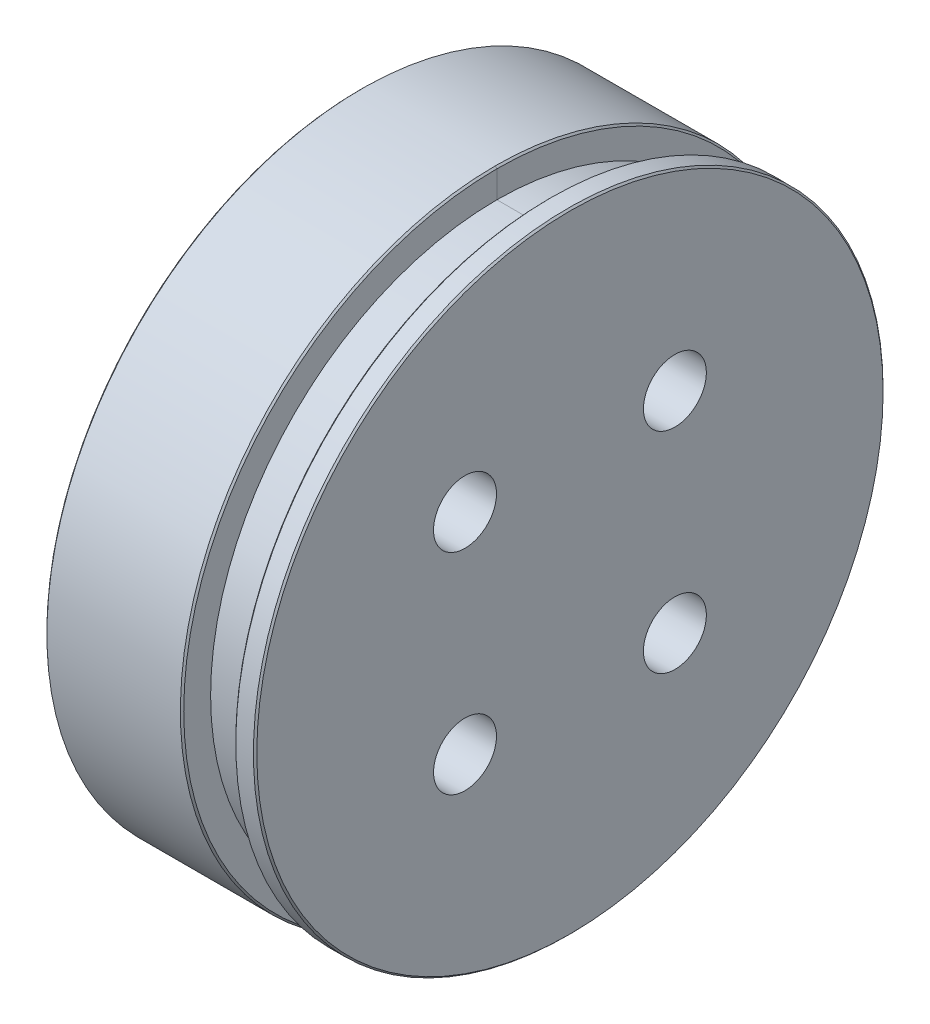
ISO-10303-21;
HEADER;
FILE_DESCRIPTION(('STEP AP214'),'2;1');
FILE_NAME('part.step','',(''),(''),'','','');
FILE_SCHEMA(('AUTOMOTIVE_DESIGN { 1 0 10303 214 1 1 1 1 }'));
ENDSEC;
DATA;
#1=APPLICATION_CONTEXT('core data for automotive mechanical design processes');
#2=APPLICATION_PROTOCOL_DEFINITION('international standard','automotive_design',2000,#1);
#3=PRODUCT_CONTEXT('',#1,'mechanical');
#4=PRODUCT('Part','Part','',(#3));
#5=PRODUCT_RELATED_PRODUCT_CATEGORY('part','',(#4));
#6=PRODUCT_DEFINITION_FORMATION('','',#4);
#7=PRODUCT_DEFINITION_CONTEXT('part definition',#1,'design');
#8=PRODUCT_DEFINITION('design','',#6,#7);
#9=PRODUCT_DEFINITION_SHAPE('','',#8);
#10=(LENGTH_UNIT() NAMED_UNIT(*) SI_UNIT(.MILLI.,.METRE.));
#11=(NAMED_UNIT(*) PLANE_ANGLE_UNIT() SI_UNIT($,.RADIAN.));
#12=(NAMED_UNIT(*) SI_UNIT($,.STERADIAN.) SOLID_ANGLE_UNIT());
#13=UNCERTAINTY_MEASURE_WITH_UNIT(LENGTH_MEASURE(1.E-05),#10,'distance_accuracy_value','');
#14=(GEOMETRIC_REPRESENTATION_CONTEXT(3) GLOBAL_UNCERTAINTY_ASSIGNED_CONTEXT((#13)) GLOBAL_UNIT_ASSIGNED_CONTEXT((#10,
#11,#12)) REPRESENTATION_CONTEXT('',''));
#15=CARTESIAN_POINT('',(0.,0.,0.));
#16=DIRECTION('',(0.,0.,1.));
#17=DIRECTION('',(1.,0.,0.));
#18=AXIS2_PLACEMENT_3D('',#15,#16,#17);
#19=CARTESIAN_POINT('',(-31.75,0.,0.));
#20=DIRECTION('',(1.,0.,0.));
#21=DIRECTION('',(0.,0.,-1.));
#22=AXIS2_PLACEMENT_3D('',#19,#20,#21);
#23=CYLINDRICAL_SURFACE('',#22,47.625);
#24=CARTESIAN_POINT('',(-31.496,0.,0.));
#25=DIRECTION('',(1.,0.,0.));
#26=DIRECTION('',(0.,0.,-1.));
#27=AXIS2_PLACEMENT_3D('',#24,#25,#26);
#28=CIRCLE('',#27,47.625);
#29=CARTESIAN_POINT('',(-31.496,0.,-47.625));
#30=VERTEX_POINT('',#29);
#31=EDGE_CURVE('E254',#30,#30,#28,.T.);
#32=ORIENTED_EDGE('',*,*,#31,.T.);
#33=EDGE_LOOP('',(#32));
#34=FACE_BOUND('',#33,.T.);
#35=CARTESIAN_POINT('',(-11.303,0.,0.));
#36=DIRECTION('',(1.,0.,0.));
#37=DIRECTION('',(0.,0.,-1.));
#38=AXIS2_PLACEMENT_3D('',#35,#36,#37);
#39=CIRCLE('',#38,47.625);
#40=CARTESIAN_POINT('',(-11.303,0.,-47.625));
#41=VERTEX_POINT('',#40);
#42=CARTESIAN_POINT('',(-11.303,47.625,0.));
#43=VERTEX_POINT('',#42);
#44=EDGE_CURVE('E244',#41,#43,#39,.F.);
#45=ORIENTED_EDGE('',*,*,#44,.T.);
#46=CARTESIAN_POINT('',(-11.303,0.,0.));
#47=DIRECTION('',(1.,0.,0.));
#48=DIRECTION('',(0.,0.,-1.));
#49=AXIS2_PLACEMENT_3D('',#46,#47,#48);
#50=CIRCLE('',#49,47.625);
#51=EDGE_CURVE('E250',#43,#41,#50,.F.);
#52=ORIENTED_EDGE('',*,*,#51,.T.);
#53=EDGE_LOOP('',(#45,#52));
#54=FACE_BOUND('',#53,.T.);
#55=ADVANCED_FACE('F47',(#34,#54),#23,.T.);
#56=CARTESIAN_POINT('',(-2.92100000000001,0.,0.));
#57=DIRECTION('',(-1.,0.,0.));
#58=DIRECTION('',(0.,0.,1.));
#59=AXIS2_PLACEMENT_3D('',#56,#57,#58);
#60=CIRCLE('',#59,47.625);
#61=CARTESIAN_POINT('',(-2.92100000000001,47.625,0.));
#62=VERTEX_POINT('',#61);
#63=CARTESIAN_POINT('',(-2.92100000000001,0.,-47.625));
#64=VERTEX_POINT('',#63);
#65=EDGE_CURVE('E270',#62,#64,#60,.F.);
#66=ORIENTED_EDGE('',*,*,#65,.T.);
#67=CARTESIAN_POINT('',(-2.92100000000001,0.,0.));
#68=DIRECTION('',(-1.,0.,0.));
#69=DIRECTION('',(0.,0.,1.));
#70=AXIS2_PLACEMENT_3D('',#67,#68,#69);
#71=CIRCLE('',#70,47.625);
#72=EDGE_CURVE('E273',#64,#62,#71,.F.);
#73=ORIENTED_EDGE('',*,*,#72,.T.);
#74=EDGE_LOOP('',(#66,#73));
#75=FACE_BOUND('',#74,.T.);
#76=CARTESIAN_POINT('',(-0.253999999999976,0.,0.));
#77=DIRECTION('',(1.,0.,0.));
#78=DIRECTION('',(0.,0.,-1.));
#79=AXIS2_PLACEMENT_3D('',#76,#77,#78);
#80=CIRCLE('',#79,47.625);
#81=CARTESIAN_POINT('',(-0.253999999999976,0.,-47.625));
#82=VERTEX_POINT('',#81);
#83=EDGE_CURVE('E266',#82,#82,#80,.F.);
#84=ORIENTED_EDGE('',*,*,#83,.T.);
#85=EDGE_LOOP('',(#84));
#86=FACE_BOUND('',#85,.T.);
#87=ADVANCED_FACE('F299',(#75,#86),#23,.T.);
#88=CARTESIAN_POINT('',(-31.75,0.,0.));
#89=DIRECTION('',(1.,0.,0.));
#90=DIRECTION('',(0.,0.,-1.));
#91=AXIS2_PLACEMENT_3D('',#88,#89,#90);
#92=PLANE('',#91);
#93=CARTESIAN_POINT('',(-31.75,0.,0.));
#94=DIRECTION('',(1.,0.,0.));
#95=DIRECTION('',(0.,0.,-1.));
#96=AXIS2_PLACEMENT_3D('',#93,#94,#95);
#97=CIRCLE('',#96,47.371);
#98=CARTESIAN_POINT('',(-31.75,0.,-47.371));
#99=VERTEX_POINT('',#98);
#100=EDGE_CURVE('E258',#99,#99,#97,.F.);
#101=ORIENTED_EDGE('',*,*,#100,.T.);
#102=EDGE_LOOP('',(#101));
#103=FACE_BOUND('',#102,.T.);
#104=CARTESIAN_POINT('',(-31.75,-15.875,15.875));
#105=DIRECTION('',(1.,0.,0.));
#106=DIRECTION('',(0.,0.,-1.));
#107=AXIS2_PLACEMENT_3D('',#104,#105,#106);
#108=CIRCLE('',#107,4.7625);
#109=CARTESIAN_POINT('',(-31.75,-15.875,11.1125));
#110=VERTEX_POINT('',#109);
#111=EDGE_CURVE('E147',#110,#110,#108,.T.);
#112=ORIENTED_EDGE('',*,*,#111,.T.);
#113=EDGE_LOOP('',(#112));
#114=FACE_BOUND('',#113,.T.);
#115=CARTESIAN_POINT('',(-31.75,-15.875,-15.875));
#116=DIRECTION('',(1.,0.,0.));
#117=DIRECTION('',(0.,0.,-1.));
#118=AXIS2_PLACEMENT_3D('',#115,#116,#117);
#119=CIRCLE('',#118,4.7625);
#120=CARTESIAN_POINT('',(-31.75,-15.875,-20.6375));
#121=VERTEX_POINT('',#120);
#122=EDGE_CURVE('E165',#121,#121,#119,.T.);
#123=ORIENTED_EDGE('',*,*,#122,.T.);
#124=EDGE_LOOP('',(#123));
#125=FACE_BOUND('',#124,.T.);
#126=CARTESIAN_POINT('',(-31.75,15.875,-15.875));
#127=DIRECTION('',(1.,0.,0.));
#128=DIRECTION('',(0.,0.,-1.));
#129=AXIS2_PLACEMENT_3D('',#126,#127,#128);
#130=CIRCLE('',#129,4.7625);
#131=CARTESIAN_POINT('',(-31.75,15.875,-20.6375));
#132=VERTEX_POINT('',#131);
#133=EDGE_CURVE('E157',#132,#132,#130,.T.);
#134=ORIENTED_EDGE('',*,*,#133,.T.);
#135=EDGE_LOOP('',(#134));
#136=FACE_BOUND('',#135,.T.);
#137=CARTESIAN_POINT('',(-31.75,15.875,15.875));
#138=DIRECTION('',(1.,0.,0.));
#139=DIRECTION('',(0.,0.,-1.));
#140=AXIS2_PLACEMENT_3D('',#137,#138,#139);
#141=CIRCLE('',#140,4.7625);
#142=CARTESIAN_POINT('',(-31.75,15.875,11.1125));
#143=VERTEX_POINT('',#142);
#144=EDGE_CURVE('E176',#143,#143,#141,.T.);
#145=ORIENTED_EDGE('',*,*,#144,.T.);
#146=EDGE_LOOP('',(#145));
#147=FACE_BOUND('',#146,.T.);
#148=CARTESIAN_POINT('',(-31.75,38.1,0.));
#149=DIRECTION('',(-1.,0.,0.));
#150=DIRECTION('',(0.,0.,1.));
#151=AXIS2_PLACEMENT_3D('',#148,#149,#150);
#152=CIRCLE('',#151,3.96875);
#153=CARTESIAN_POINT('',(-31.75,38.1,3.96875));
#154=VERTEX_POINT('',#153);
#155=EDGE_CURVE('E208',#154,#154,#152,.T.);
#156=ORIENTED_EDGE('',*,*,#155,.F.);
#157=EDGE_LOOP('',(#156));
#158=FACE_BOUND('',#157,.T.);
#159=CARTESIAN_POINT('',(-31.75,26.9407683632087,26.940768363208));
#160=DIRECTION('',(-1.,0.,0.));
#161=DIRECTION('',(0.,0.,1.));
#162=AXIS2_PLACEMENT_3D('',#159,#160,#161);
#163=CIRCLE('',#162,3.96874999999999);
#164=CARTESIAN_POINT('',(-31.75,26.9407683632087,30.909518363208));
#165=VERTEX_POINT('',#164);
#166=EDGE_CURVE('E217',#165,#165,#163,.T.);
#167=ORIENTED_EDGE('',*,*,#166,.F.);
#168=EDGE_LOOP('',(#167));
#169=FACE_BOUND('',#168,.T.);
#170=CARTESIAN_POINT('',(-31.75,0.,38.1));
#171=DIRECTION('',(-1.,0.,0.));
#172=DIRECTION('',(0.,0.,1.));
#173=AXIS2_PLACEMENT_3D('',#170,#171,#172);
#174=CIRCLE('',#173,3.96875);
#175=CARTESIAN_POINT('',(-31.75,0.,42.06875));
#176=VERTEX_POINT('',#175);
#177=EDGE_CURVE('E225',#176,#176,#174,.T.);
#178=ORIENTED_EDGE('',*,*,#177,.F.);
#179=EDGE_LOOP('',(#178));
#180=FACE_BOUND('',#179,.T.);
#181=CARTESIAN_POINT('',(-31.75,-26.9407683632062,26.9407683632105));
#182=DIRECTION('',(-1.,0.,0.));
#183=DIRECTION('',(0.,0.,1.));
#184=AXIS2_PLACEMENT_3D('',#181,#182,#183);
#185=CIRCLE('',#184,3.96875);
#186=CARTESIAN_POINT('',(-31.75,-26.9407683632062,30.9095183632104));
#187=VERTEX_POINT('',#186);
#188=EDGE_CURVE('E233',#187,#187,#185,.T.);
#189=ORIENTED_EDGE('',*,*,#188,.F.);
#190=EDGE_LOOP('',(#189));
#191=FACE_BOUND('',#190,.T.);
#192=CARTESIAN_POINT('',(-31.75,-38.1,0.));
#193=DIRECTION('',(-1.,0.,0.));
#194=DIRECTION('',(0.,0.,1.));
#195=AXIS2_PLACEMENT_3D('',#192,#193,#194);
#196=CIRCLE('',#195,3.96875);
#197=CARTESIAN_POINT('',(-31.75,-38.1,3.96875));
#198=VERTEX_POINT('',#197);
#199=EDGE_CURVE('E184',#198,#198,#196,.T.);
#200=ORIENTED_EDGE('',*,*,#199,.F.);
#201=EDGE_LOOP('',(#200));
#202=FACE_BOUND('',#201,.T.);
#203=CARTESIAN_POINT('',(-31.75,-26.9407683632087,-26.9407683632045));
#204=DIRECTION('',(-1.,0.,0.));
#205=DIRECTION('',(0.,0.,1.));
#206=AXIS2_PLACEMENT_3D('',#203,#204,#205);
#207=CIRCLE('',#206,3.96875);
#208=CARTESIAN_POINT('',(-31.75,-26.9407683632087,-22.9720183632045));
#209=VERTEX_POINT('',#208);
#210=EDGE_CURVE('E193',#209,#209,#207,.T.);
#211=ORIENTED_EDGE('',*,*,#210,.F.);
#212=EDGE_LOOP('',(#211));
#213=FACE_BOUND('',#212,.T.);
#214=CARTESIAN_POINT('',(-31.75,0.,-38.1));
#215=DIRECTION('',(-1.,0.,0.));
#216=DIRECTION('',(0.,0.,1.));
#217=AXIS2_PLACEMENT_3D('',#214,#215,#216);
#218=CIRCLE('',#217,3.96875);
#219=CARTESIAN_POINT('',(-31.75,0.,-34.13125));
#220=VERTEX_POINT('',#219);
#221=EDGE_CURVE('E201',#220,#220,#218,.T.);
#222=ORIENTED_EDGE('',*,*,#221,.F.);
#223=EDGE_LOOP('',(#222));
#224=FACE_BOUND('',#223,.T.);
#225=CARTESIAN_POINT('',(-31.75,26.9407683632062,-26.940768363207));
#226=DIRECTION('',(-1.,0.,0.));
#227=DIRECTION('',(0.,0.,1.));
#228=AXIS2_PLACEMENT_3D('',#225,#226,#227);
#229=CIRCLE('',#228,3.96875);
#230=CARTESIAN_POINT('',(-31.75,26.9407683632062,-22.972018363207));
#231=VERTEX_POINT('',#230);
#232=EDGE_CURVE('E212',#231,#231,#229,.T.);
#233=ORIENTED_EDGE('',*,*,#232,.F.);
#234=EDGE_LOOP('',(#233));
#235=FACE_BOUND('',#234,.T.);
#236=ADVANCED_FACE('F305',(#103,#114,#125,#136,#147,#158,#169,#180,#191,#202,#213,#224,#235),
#92,.F.);
#237=CARTESIAN_POINT('',(0.,0.,0.));
#238=DIRECTION('',(1.,0.,0.));
#239=DIRECTION('',(0.,0.,-1.));
#240=AXIS2_PLACEMENT_3D('',#237,#238,#239);
#241=PLANE('',#240);
#242=CARTESIAN_POINT('',(0.,0.,0.));
#243=DIRECTION('',(1.,0.,0.));
#244=DIRECTION('',(0.,0.,-1.));
#245=AXIS2_PLACEMENT_3D('',#242,#243,#244);
#246=CIRCLE('',#245,47.371);
#247=CARTESIAN_POINT('',(0.,0.,-47.371));
#248=VERTEX_POINT('',#247);
#249=EDGE_CURVE('E280',#248,#248,#246,.T.);
#250=ORIENTED_EDGE('',*,*,#249,.T.);
#251=EDGE_LOOP('',(#250));
#252=FACE_BOUND('',#251,.T.);
#253=CARTESIAN_POINT('',(0.,-15.875,15.875));
#254=DIRECTION('',(1.,0.,0.));
#255=DIRECTION('',(0.,0.,-1.));
#256=AXIS2_PLACEMENT_3D('',#253,#254,#255);
#257=CIRCLE('',#256,4.7625);
#258=CARTESIAN_POINT('',(0.,-15.875,11.1125));
#259=VERTEX_POINT('',#258);
#260=EDGE_CURVE('E169',#259,#259,#257,.T.);
#261=ORIENTED_EDGE('',*,*,#260,.F.);
#262=EDGE_LOOP('',(#261));
#263=FACE_BOUND('',#262,.T.);
#264=CARTESIAN_POINT('',(0.,-15.875,-15.875));
#265=DIRECTION('',(1.,0.,0.));
#266=DIRECTION('',(0.,0.,-1.));
#267=AXIS2_PLACEMENT_3D('',#264,#265,#266);
#268=CIRCLE('',#267,4.7625);
#269=CARTESIAN_POINT('',(0.,-15.875,-20.6375));
#270=VERTEX_POINT('',#269);
#271=EDGE_CURVE('E161',#270,#270,#268,.T.);
#272=ORIENTED_EDGE('',*,*,#271,.F.);
#273=EDGE_LOOP('',(#272));
#274=FACE_BOUND('',#273,.T.);
#275=CARTESIAN_POINT('',(0.,15.875,-15.875));
#276=DIRECTION('',(1.,0.,0.));
#277=DIRECTION('',(0.,0.,-1.));
#278=AXIS2_PLACEMENT_3D('',#275,#276,#277);
#279=CIRCLE('',#278,4.7625);
#280=CARTESIAN_POINT('',(0.,15.875,-20.6375));
#281=VERTEX_POINT('',#280);
#282=EDGE_CURVE('E152',#281,#281,#279,.T.);
#283=ORIENTED_EDGE('',*,*,#282,.F.);
#284=EDGE_LOOP('',(#283));
#285=FACE_BOUND('',#284,.T.);
#286=CARTESIAN_POINT('',(0.,15.875,15.875));
#287=DIRECTION('',(1.,0.,0.));
#288=DIRECTION('',(0.,0.,-1.));
#289=AXIS2_PLACEMENT_3D('',#286,#287,#288);
#290=CIRCLE('',#289,4.7625);
#291=CARTESIAN_POINT('',(0.,15.875,11.1125));
#292=VERTEX_POINT('',#291);
#293=EDGE_CURVE('E156',#292,#292,#290,.T.);
#294=ORIENTED_EDGE('',*,*,#293,.F.);
#295=EDGE_LOOP('',(#294));
#296=FACE_BOUND('',#295,.T.);
#297=ADVANCED_FACE('F309',(#252,#263,#274,#285,#296),#241,.T.);
#298=CARTESIAN_POINT('',(-15.875,26.9407683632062,-26.940768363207));
#299=DIRECTION('',(-1.,0.,0.));
#300=DIRECTION('',(0.,0.,1.));
#301=AXIS2_PLACEMENT_3D('',#298,#299,#300);
#302=CYLINDRICAL_SURFACE('',#301,3.96875);
#303=CARTESIAN_POINT('',(-15.875,26.9407683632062,-26.940768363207));
#304=DIRECTION('',(-1.,0.,0.));
#305=DIRECTION('',(0.,0.,1.));
#306=AXIS2_PLACEMENT_3D('',#303,#304,#305);
#307=CIRCLE('',#306,3.96875);
#308=CARTESIAN_POINT('',(-15.875,26.9407683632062,-22.972018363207));
#309=VERTEX_POINT('',#308);
#310=EDGE_CURVE('E240',#309,#309,#307,.T.);
#311=ORIENTED_EDGE('',*,*,#310,.F.);
#312=EDGE_LOOP('',(#311));
#313=FACE_BOUND('',#312,.T.);
#314=ORIENTED_EDGE('',*,*,#232,.T.);
#315=EDGE_LOOP('',(#314));
#316=FACE_BOUND('',#315,.T.);
#317=ADVANCED_FACE('F555',(#313,#316),#302,.F.);
#318=CARTESIAN_POINT('',(-15.875,26.9407683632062,-26.940768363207));
#319=DIRECTION('',(-1.,0.,0.));
#320=DIRECTION('',(0.,0.,1.));
#321=AXIS2_PLACEMENT_3D('',#318,#319,#320);
#322=PLANE('',#321);
#323=ORIENTED_EDGE('',*,*,#310,.T.);
#324=EDGE_LOOP('',(#323));
#325=FACE_BOUND('',#324,.T.);
#326=ADVANCED_FACE('F547',(#325),#322,.T.);
#327=CARTESIAN_POINT('',(-15.875,0.,-38.1));
#328=DIRECTION('',(-1.,0.,0.));
#329=DIRECTION('',(0.,0.,1.));
#330=AXIS2_PLACEMENT_3D('',#327,#328,#329);
#331=CYLINDRICAL_SURFACE('',#330,3.96875);
#332=CARTESIAN_POINT('',(-15.875,0.,-38.1));
#333=DIRECTION('',(-1.,0.,0.));
#334=DIRECTION('',(0.,0.,1.));
#335=AXIS2_PLACEMENT_3D('',#332,#333,#334);
#336=CIRCLE('',#335,3.96875);
#337=CARTESIAN_POINT('',(-15.875,0.,-34.13125));
#338=VERTEX_POINT('',#337);
#339=EDGE_CURVE('E180',#338,#338,#336,.T.);
#340=ORIENTED_EDGE('',*,*,#339,.F.);
#341=EDGE_LOOP('',(#340));
#342=FACE_BOUND('',#341,.T.);
#343=ORIENTED_EDGE('',*,*,#221,.T.);
#344=EDGE_LOOP('',(#343));
#345=FACE_BOUND('',#344,.T.);
#346=ADVANCED_FACE('F539',(#342,#345),#331,.F.);
#347=CARTESIAN_POINT('',(-15.875,0.,-38.1));
#348=DIRECTION('',(-1.,0.,0.));
#349=DIRECTION('',(0.,0.,1.));
#350=AXIS2_PLACEMENT_3D('',#347,#348,#349);
#351=PLANE('',#350);
#352=ORIENTED_EDGE('',*,*,#339,.T.);
#353=EDGE_LOOP('',(#352));
#354=FACE_BOUND('',#353,.T.);
#355=ADVANCED_FACE('F531',(#354),#351,.T.);
#356=CARTESIAN_POINT('',(-15.875,-26.9407683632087,-26.9407683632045));
#357=DIRECTION('',(-1.,0.,0.));
#358=DIRECTION('',(0.,0.,1.));
#359=AXIS2_PLACEMENT_3D('',#356,#357,#358);
#360=CYLINDRICAL_SURFACE('',#359,3.96875);
#361=CARTESIAN_POINT('',(-15.875,-26.9407683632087,-26.9407683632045));
#362=DIRECTION('',(-1.,0.,0.));
#363=DIRECTION('',(0.,0.,1.));
#364=AXIS2_PLACEMENT_3D('',#361,#362,#363);
#365=CIRCLE('',#364,3.96875);
#366=CARTESIAN_POINT('',(-15.875,-26.9407683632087,-22.9720183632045));
#367=VERTEX_POINT('',#366);
#368=EDGE_CURVE('E197',#367,#367,#365,.T.);
#369=ORIENTED_EDGE('',*,*,#368,.F.);
#370=EDGE_LOOP('',(#369));
#371=FACE_BOUND('',#370,.T.);
#372=ORIENTED_EDGE('',*,*,#210,.T.);
#373=EDGE_LOOP('',(#372));
#374=FACE_BOUND('',#373,.T.);
#375=ADVANCED_FACE('F523',(#371,#374),#360,.F.);
#376=CARTESIAN_POINT('',(-15.875,-26.9407683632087,-26.9407683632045));
#377=DIRECTION('',(-1.,0.,0.));
#378=DIRECTION('',(0.,0.,1.));
#379=AXIS2_PLACEMENT_3D('',#376,#377,#378);
#380=PLANE('',#379);
#381=ORIENTED_EDGE('',*,*,#368,.T.);
#382=EDGE_LOOP('',(#381));
#383=FACE_BOUND('',#382,.T.);
#384=ADVANCED_FACE('F515',(#383),#380,.T.);
#385=CARTESIAN_POINT('',(-15.875,-38.1,0.));
#386=DIRECTION('',(-1.,0.,0.));
#387=DIRECTION('',(0.,0.,1.));
#388=AXIS2_PLACEMENT_3D('',#385,#386,#387);
#389=CYLINDRICAL_SURFACE('',#388,3.96875);
#390=CARTESIAN_POINT('',(-15.875,-38.1,0.));
#391=DIRECTION('',(-1.,0.,0.));
#392=DIRECTION('',(0.,0.,1.));
#393=AXIS2_PLACEMENT_3D('',#390,#391,#392);
#394=CIRCLE('',#393,3.96875);
#395=CARTESIAN_POINT('',(-15.875,-38.1,3.96875));
#396=VERTEX_POINT('',#395);
#397=EDGE_CURVE('E189',#396,#396,#394,.T.);
#398=ORIENTED_EDGE('',*,*,#397,.F.);
#399=EDGE_LOOP('',(#398));
#400=FACE_BOUND('',#399,.T.);
#401=ORIENTED_EDGE('',*,*,#199,.T.);
#402=EDGE_LOOP('',(#401));
#403=FACE_BOUND('',#402,.T.);
#404=ADVANCED_FACE('F507',(#400,#403),#389,.F.);
#405=CARTESIAN_POINT('',(-15.875,-38.1,0.));
#406=DIRECTION('',(-1.,0.,0.));
#407=DIRECTION('',(0.,0.,1.));
#408=AXIS2_PLACEMENT_3D('',#405,#406,#407);
#409=PLANE('',#408);
#410=ORIENTED_EDGE('',*,*,#397,.T.);
#411=EDGE_LOOP('',(#410));
#412=FACE_BOUND('',#411,.T.);
#413=ADVANCED_FACE('F499',(#412),#409,.T.);
#414=CARTESIAN_POINT('',(-15.875,-26.9407683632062,26.9407683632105));
#415=DIRECTION('',(-1.,0.,0.));
#416=DIRECTION('',(0.,0.,1.));
#417=AXIS2_PLACEMENT_3D('',#414,#415,#416);
#418=CYLINDRICAL_SURFACE('',#417,3.96875);
#419=CARTESIAN_POINT('',(-15.875,-26.9407683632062,26.9407683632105));
#420=DIRECTION('',(-1.,0.,0.));
#421=DIRECTION('',(0.,0.,1.));
#422=AXIS2_PLACEMENT_3D('',#419,#420,#421);
#423=CIRCLE('',#422,3.96875);
#424=CARTESIAN_POINT('',(-15.875,-26.9407683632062,30.9095183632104));
#425=VERTEX_POINT('',#424);
#426=EDGE_CURVE('E188',#425,#425,#423,.T.);
#427=ORIENTED_EDGE('',*,*,#426,.F.);
#428=EDGE_LOOP('',(#427));
#429=FACE_BOUND('',#428,.T.);
#430=ORIENTED_EDGE('',*,*,#188,.T.);
#431=EDGE_LOOP('',(#430));
#432=FACE_BOUND('',#431,.T.);
#433=ADVANCED_FACE('F491',(#429,#432),#418,.F.);
#434=CARTESIAN_POINT('',(-15.875,-26.9407683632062,26.9407683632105));
#435=DIRECTION('',(-1.,0.,0.));
#436=DIRECTION('',(0.,0.,1.));
#437=AXIS2_PLACEMENT_3D('',#434,#435,#436);
#438=PLANE('',#437);
#439=ORIENTED_EDGE('',*,*,#426,.T.);
#440=EDGE_LOOP('',(#439));
#441=FACE_BOUND('',#440,.T.);
#442=ADVANCED_FACE('F483',(#441),#438,.T.);
#443=CARTESIAN_POINT('',(-15.875,0.,38.1));
#444=DIRECTION('',(-1.,0.,0.));
#445=DIRECTION('',(0.,0.,1.));
#446=AXIS2_PLACEMENT_3D('',#443,#444,#445);
#447=CYLINDRICAL_SURFACE('',#446,3.96875);
#448=CARTESIAN_POINT('',(-15.875,0.,38.1));
#449=DIRECTION('',(-1.,0.,0.));
#450=DIRECTION('',(0.,0.,1.));
#451=AXIS2_PLACEMENT_3D('',#448,#449,#450);
#452=CIRCLE('',#451,3.96875);
#453=CARTESIAN_POINT('',(-15.875,0.,42.06875));
#454=VERTEX_POINT('',#453);
#455=EDGE_CURVE('E229',#454,#454,#452,.T.);
#456=ORIENTED_EDGE('',*,*,#455,.F.);
#457=EDGE_LOOP('',(#456));
#458=FACE_BOUND('',#457,.T.);
#459=ORIENTED_EDGE('',*,*,#177,.T.);
#460=EDGE_LOOP('',(#459));
#461=FACE_BOUND('',#460,.T.);
#462=ADVANCED_FACE('F475',(#458,#461),#447,.F.);
#463=CARTESIAN_POINT('',(-15.875,0.,38.1));
#464=DIRECTION('',(-1.,0.,0.));
#465=DIRECTION('',(0.,0.,1.));
#466=AXIS2_PLACEMENT_3D('',#463,#464,#465);
#467=PLANE('',#466);
#468=ORIENTED_EDGE('',*,*,#455,.T.);
#469=EDGE_LOOP('',(#468));
#470=FACE_BOUND('',#469,.T.);
#471=ADVANCED_FACE('F467',(#470),#467,.T.);
#472=CARTESIAN_POINT('',(-15.875,26.9407683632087,26.940768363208));
#473=DIRECTION('',(-1.,0.,0.));
#474=DIRECTION('',(0.,0.,1.));
#475=AXIS2_PLACEMENT_3D('',#472,#473,#474);
#476=CYLINDRICAL_SURFACE('',#475,3.96874999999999);
#477=CARTESIAN_POINT('',(-15.875,26.9407683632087,26.940768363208));
#478=DIRECTION('',(-1.,0.,0.));
#479=DIRECTION('',(0.,0.,1.));
#480=AXIS2_PLACEMENT_3D('',#477,#478,#479);
#481=CIRCLE('',#480,3.96874999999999);
#482=CARTESIAN_POINT('',(-15.875,26.9407683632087,30.909518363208));
#483=VERTEX_POINT('',#482);
#484=EDGE_CURVE('E221',#483,#483,#481,.T.);
#485=ORIENTED_EDGE('',*,*,#484,.F.);
#486=EDGE_LOOP('',(#485));
#487=FACE_BOUND('',#486,.T.);
#488=ORIENTED_EDGE('',*,*,#166,.T.);
#489=EDGE_LOOP('',(#488));
#490=FACE_BOUND('',#489,.T.);
#491=ADVANCED_FACE('F459',(#487,#490),#476,.F.);
#492=CARTESIAN_POINT('',(-15.875,26.9407683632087,26.940768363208));
#493=DIRECTION('',(-1.,0.,0.));
#494=DIRECTION('',(0.,0.,1.));
#495=AXIS2_PLACEMENT_3D('',#492,#493,#494);
#496=PLANE('',#495);
#497=ORIENTED_EDGE('',*,*,#484,.T.);
#498=EDGE_LOOP('',(#497));
#499=FACE_BOUND('',#498,.T.);
#500=ADVANCED_FACE('F451',(#499),#496,.T.);
#501=CARTESIAN_POINT('',(-15.875,38.1,0.));
#502=DIRECTION('',(-1.,0.,0.));
#503=DIRECTION('',(0.,0.,1.));
#504=AXIS2_PLACEMENT_3D('',#501,#502,#503);
#505=CYLINDRICAL_SURFACE('',#504,3.96875);
#506=CARTESIAN_POINT('',(-15.875,38.1,0.));
#507=DIRECTION('',(-1.,0.,0.));
#508=DIRECTION('',(0.,0.,1.));
#509=AXIS2_PLACEMENT_3D('',#506,#507,#508);
#510=CIRCLE('',#509,3.96875);
#511=CARTESIAN_POINT('',(-15.875,38.1,3.96875));
#512=VERTEX_POINT('',#511);
#513=EDGE_CURVE('E213',#512,#512,#510,.T.);
#514=ORIENTED_EDGE('',*,*,#513,.F.);
#515=EDGE_LOOP('',(#514));
#516=FACE_BOUND('',#515,.T.);
#517=ORIENTED_EDGE('',*,*,#155,.T.);
#518=EDGE_LOOP('',(#517));
#519=FACE_BOUND('',#518,.T.);
#520=ADVANCED_FACE('F443',(#516,#519),#505,.F.);
#521=CARTESIAN_POINT('',(-15.875,38.1,0.));
#522=DIRECTION('',(-1.,0.,0.));
#523=DIRECTION('',(0.,0.,1.));
#524=AXIS2_PLACEMENT_3D('',#521,#522,#523);
#525=PLANE('',#524);
#526=ORIENTED_EDGE('',*,*,#513,.T.);
#527=EDGE_LOOP('',(#526));
#528=FACE_BOUND('',#527,.T.);
#529=ADVANCED_FACE('F435',(#528),#525,.T.);
#530=CARTESIAN_POINT('',(-31.75,15.875,15.875));
#531=DIRECTION('',(1.,0.,0.));
#532=DIRECTION('',(0.,0.,-1.));
#533=AXIS2_PLACEMENT_3D('',#530,#531,#532);
#534=CYLINDRICAL_SURFACE('',#533,4.7625);
#535=ORIENTED_EDGE('',*,*,#144,.F.);
#536=EDGE_LOOP('',(#535));
#537=FACE_BOUND('',#536,.T.);
#538=ORIENTED_EDGE('',*,*,#293,.T.);
#539=EDGE_LOOP('',(#538));
#540=FACE_BOUND('',#539,.T.);
#541=ADVANCED_FACE('F427',(#537,#540),#534,.F.);
#542=CARTESIAN_POINT('',(-31.75,15.875,-15.875));
#543=DIRECTION('',(1.,0.,0.));
#544=DIRECTION('',(0.,0.,-1.));
#545=AXIS2_PLACEMENT_3D('',#542,#543,#544);
#546=CYLINDRICAL_SURFACE('',#545,4.7625);
#547=ORIENTED_EDGE('',*,*,#133,.F.);
#548=EDGE_LOOP('',(#547));
#549=FACE_BOUND('',#548,.T.);
#550=ORIENTED_EDGE('',*,*,#282,.T.);
#551=EDGE_LOOP('',(#550));
#552=FACE_BOUND('',#551,.T.);
#553=ADVANCED_FACE('F419',(#549,#552),#546,.F.);
#554=CARTESIAN_POINT('',(-31.75,-15.875,-15.875));
#555=DIRECTION('',(1.,0.,0.));
#556=DIRECTION('',(0.,0.,-1.));
#557=AXIS2_PLACEMENT_3D('',#554,#555,#556);
#558=CYLINDRICAL_SURFACE('',#557,4.7625);
#559=ORIENTED_EDGE('',*,*,#122,.F.);
#560=EDGE_LOOP('',(#559));
#561=FACE_BOUND('',#560,.T.);
#562=ORIENTED_EDGE('',*,*,#271,.T.);
#563=EDGE_LOOP('',(#562));
#564=FACE_BOUND('',#563,.T.);
#565=ADVANCED_FACE('F411',(#561,#564),#558,.F.);
#566=CARTESIAN_POINT('',(-31.75,-15.875,15.875));
#567=DIRECTION('',(1.,0.,0.));
#568=DIRECTION('',(0.,0.,-1.));
#569=AXIS2_PLACEMENT_3D('',#566,#567,#568);
#570=CYLINDRICAL_SURFACE('',#569,4.7625);
#571=ORIENTED_EDGE('',*,*,#111,.F.);
#572=EDGE_LOOP('',(#571));
#573=FACE_BOUND('',#572,.T.);
#574=ORIENTED_EDGE('',*,*,#260,.T.);
#575=EDGE_LOOP('',(#574));
#576=FACE_BOUND('',#575,.T.);
#577=ADVANCED_FACE('F404',(#573,#576),#570,.F.);
#578=CARTESIAN_POINT('',(-11.049,0.,-47.625));
#579=DIRECTION('',(1.,0.,0.));
#580=DIRECTION('',(0.,0.,-1.));
#581=AXIS2_PLACEMENT_3D('',#578,#579,#580);
#582=PLANE('',#581);
#583=DIRECTION('',(0.,-1.,0.));
#584=VECTOR('',#583,1.);
#585=CARTESIAN_POINT('',(-11.049,47.625,0.));
#586=LINE('',#585,#584);
#587=CARTESIAN_POINT('',(-11.049,47.371,0.));
#588=VERTEX_POINT('',#587);
#589=CARTESIAN_POINT('',(-11.049,43.307,0.));
#590=VERTEX_POINT('',#589);
#591=EDGE_CURVE('E103',#588,#590,#586,.T.);
#592=ORIENTED_EDGE('',*,*,#591,.F.);
#593=CARTESIAN_POINT('',(-11.049,0.,0.));
#594=DIRECTION('',(1.,0.,0.));
#595=DIRECTION('',(0.,0.,-1.));
#596=AXIS2_PLACEMENT_3D('',#593,#594,#595);
#597=CIRCLE('',#596,47.371);
#598=CARTESIAN_POINT('',(-11.049,0.,-47.371));
#599=VERTEX_POINT('',#598);
#600=EDGE_CURVE('E11',#588,#599,#597,.T.);
#601=ORIENTED_EDGE('',*,*,#600,.T.);
#602=DIRECTION('',(0.,0.,1.));
#603=VECTOR('',#602,1.);
#604=CARTESIAN_POINT('',(-11.049,0.,-47.625));
#605=LINE('',#604,#603);
#606=CARTESIAN_POINT('',(-11.049,0.,-43.307));
#607=VERTEX_POINT('',#606);
#608=EDGE_CURVE('E122',#599,#607,#605,.T.);
#609=ORIENTED_EDGE('',*,*,#608,.T.);
#610=CARTESIAN_POINT('',(-11.049,0.,0.));
#611=DIRECTION('',(-1.,0.,0.));
#612=DIRECTION('',(0.,0.,-1.));
#613=AXIS2_PLACEMENT_3D('',#610,#611,#612);
#614=CIRCLE('',#613,43.307);
#615=EDGE_CURVE('E124',#607,#590,#614,.T.);
#616=ORIENTED_EDGE('',*,*,#615,.T.);
#617=EDGE_LOOP('',(#592,#601,#609,#616));
#618=FACE_BOUND('',#617,.T.);
#619=ADVANCED_FACE('F125',(#618),#582,.T.);
#620=CARTESIAN_POINT('',(-11.049,47.625,0.));
#621=DIRECTION('',(1.,0.,0.));
#622=DIRECTION('',(0.,0.,-1.));
#623=AXIS2_PLACEMENT_3D('',#620,#621,#622);
#624=PLANE('',#623);
#625=ORIENTED_EDGE('',*,*,#608,.F.);
#626=CARTESIAN_POINT('',(-11.049,0.,0.));
#627=DIRECTION('',(1.,0.,0.));
#628=DIRECTION('',(0.,0.,-1.));
#629=AXIS2_PLACEMENT_3D('',#626,#627,#628);
#630=CIRCLE('',#629,47.371);
#631=EDGE_CURVE('E58',#599,#588,#630,.T.);
#632=ORIENTED_EDGE('',*,*,#631,.T.);
#633=ORIENTED_EDGE('',*,*,#591,.T.);
#634=CARTESIAN_POINT('',(-11.049,0.,0.));
#635=DIRECTION('',(-1.,0.,0.));
#636=DIRECTION('',(0.,1.,0.));
#637=AXIS2_PLACEMENT_3D('',#634,#635,#636);
#638=CIRCLE('',#637,43.307);
#639=EDGE_CURVE('E106',#590,#607,#638,.T.);
#640=ORIENTED_EDGE('',*,*,#639,.T.);
#641=EDGE_LOOP('',(#625,#632,#633,#640));
#642=FACE_BOUND('',#641,.T.);
#643=ADVANCED_FACE('F105',(#642),#624,.T.);
#644=CARTESIAN_POINT('',(0.,0.,0.));
#645=DIRECTION('',(-1.,0.,0.));
#646=DIRECTION('',(0.,0.,1.));
#647=AXIS2_PLACEMENT_3D('',#644,#645,#646);
#648=CYLINDRICAL_SURFACE('',#647,43.307);
#649=CARTESIAN_POINT('',(-3.175,0.,0.));
#650=DIRECTION('',(-1.,0.,0.));
#651=DIRECTION('',(0.,1.,0.));
#652=AXIS2_PLACEMENT_3D('',#649,#650,#651);
#653=CIRCLE('',#652,43.307);
#654=CARTESIAN_POINT('',(-3.175,43.307,0.));
#655=VERTEX_POINT('',#654);
#656=CARTESIAN_POINT('',(-3.175,0.,-43.307));
#657=VERTEX_POINT('',#656);
#658=EDGE_CURVE('E143',#655,#657,#653,.T.);
#659=ORIENTED_EDGE('',*,*,#658,.T.);
#660=DIRECTION('',(1.,0.,0.));
#661=VECTOR('',#660,1.);
#662=CARTESIAN_POINT('',(-3.175,0.,-43.307));
#663=LINE('',#662,#661);
#664=EDGE_CURVE('E120',#607,#657,#663,.T.);
#665=ORIENTED_EDGE('',*,*,#664,.F.);
#666=ORIENTED_EDGE('',*,*,#639,.F.);
#667=DIRECTION('',(1.,0.,0.));
#668=VECTOR('',#667,1.);
#669=CARTESIAN_POINT('',(-3.175,43.307,0.));
#670=LINE('',#669,#668);
#671=EDGE_CURVE('E110',#590,#655,#670,.T.);
#672=ORIENTED_EDGE('',*,*,#671,.T.);
#673=EDGE_LOOP('',(#659,#665,#666,#672));
#674=FACE_BOUND('',#673,.T.);
#675=ADVANCED_FACE('F116',(#674),#648,.T.);
#676=CARTESIAN_POINT('',(-3.175,47.625,0.));
#677=DIRECTION('',(-1.,0.,0.));
#678=DIRECTION('',(0.,0.,1.));
#679=AXIS2_PLACEMENT_3D('',#676,#677,#678);
#680=PLANE('',#679);
#681=DIRECTION('',(0.,1.,0.));
#682=VECTOR('',#681,1.);
#683=CARTESIAN_POINT('',(-3.175,47.625,0.));
#684=LINE('',#683,#682);
#685=CARTESIAN_POINT('',(-3.175,47.371,0.));
#686=VERTEX_POINT('',#685);
#687=EDGE_CURVE('E135',#655,#686,#684,.T.);
#688=ORIENTED_EDGE('',*,*,#687,.T.);
#689=CARTESIAN_POINT('',(-3.175,0.,0.));
#690=DIRECTION('',(-1.,0.,0.));
#691=DIRECTION('',(0.,0.,1.));
#692=AXIS2_PLACEMENT_3D('',#689,#690,#691);
#693=CIRCLE('',#692,47.371);
#694=CARTESIAN_POINT('',(-3.175,0.,-47.371));
#695=VERTEX_POINT('',#694);
#696=EDGE_CURVE('E262',#686,#695,#693,.T.);
#697=ORIENTED_EDGE('',*,*,#696,.T.);
#698=DIRECTION('',(0.,0.,-1.));
#699=VECTOR('',#698,1.);
#700=CARTESIAN_POINT('',(-3.175,0.,-47.625));
#701=LINE('',#700,#699);
#702=EDGE_CURVE('E129',#657,#695,#701,.T.);
#703=ORIENTED_EDGE('',*,*,#702,.F.);
#704=ORIENTED_EDGE('',*,*,#658,.F.);
#705=EDGE_LOOP('',(#688,#697,#703,#704));
#706=FACE_BOUND('',#705,.T.);
#707=ADVANCED_FACE('F378',(#706),#680,.T.);
#708=CARTESIAN_POINT('',(0.,0.,0.));
#709=DIRECTION('',(-1.,0.,0.));
#710=DIRECTION('',(0.,0.,1.));
#711=AXIS2_PLACEMENT_3D('',#708,#709,#710);
#712=CYLINDRICAL_SURFACE('',#711,43.307);
#713=ORIENTED_EDGE('',*,*,#671,.F.);
#714=ORIENTED_EDGE('',*,*,#615,.F.);
#715=ORIENTED_EDGE('',*,*,#664,.T.);
#716=CARTESIAN_POINT('',(-3.175,0.,0.));
#717=DIRECTION('',(-1.,0.,0.));
#718=DIRECTION('',(0.,0.,-1.));
#719=AXIS2_PLACEMENT_3D('',#716,#717,#718);
#720=CIRCLE('',#719,43.307);
#721=EDGE_CURVE('E128',#657,#655,#720,.T.);
#722=ORIENTED_EDGE('',*,*,#721,.T.);
#723=EDGE_LOOP('',(#713,#714,#715,#722));
#724=FACE_BOUND('',#723,.T.);
#725=ADVANCED_FACE('F131',(#724),#712,.T.);
#726=CARTESIAN_POINT('',(-3.175,0.,-47.625));
#727=DIRECTION('',(-1.,0.,0.));
#728=DIRECTION('',(0.,0.,1.));
#729=AXIS2_PLACEMENT_3D('',#726,#727,#728);
#730=PLANE('',#729);
#731=ORIENTED_EDGE('',*,*,#702,.T.);
#732=CARTESIAN_POINT('',(-3.175,0.,0.));
#733=DIRECTION('',(-1.,0.,0.));
#734=DIRECTION('',(0.,0.,1.));
#735=AXIS2_PLACEMENT_3D('',#732,#733,#734);
#736=CIRCLE('',#735,47.371);
#737=EDGE_CURVE('E277',#695,#686,#736,.T.);
#738=ORIENTED_EDGE('',*,*,#737,.T.);
#739=ORIENTED_EDGE('',*,*,#687,.F.);
#740=ORIENTED_EDGE('',*,*,#721,.F.);
#741=EDGE_LOOP('',(#731,#738,#739,#740));
#742=FACE_BOUND('',#741,.T.);
#743=ADVANCED_FACE('F319',(#742),#730,.T.);
#744=CARTESIAN_POINT('',(-31.496,0.,0.));
#745=DIRECTION('',(1.,0.,0.));
#746=DIRECTION('',(0.,0.,-1.));
#747=AXIS2_PLACEMENT_3D('',#744,#745,#746);
#748=CONICAL_SURFACE('',#747,47.625,0.785398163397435);
#749=ORIENTED_EDGE('',*,*,#100,.F.);
#750=EDGE_LOOP('',(#749));
#751=FACE_BOUND('',#750,.T.);
#752=ORIENTED_EDGE('',*,*,#31,.F.);
#753=EDGE_LOOP('',(#752));
#754=FACE_BOUND('',#753,.T.);
#755=ADVANCED_FACE('F312',(#751,#754),#748,.T.);
#756=CARTESIAN_POINT('',(-3.175,0.,0.));
#757=DIRECTION('',(1.,0.,0.));
#758=DIRECTION('',(0.,0.,-1.));
#759=AXIS2_PLACEMENT_3D('',#756,#757,#758);
#760=CONICAL_SURFACE('',#759,47.371,0.785398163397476);
#761=DIRECTION('',(-0.707106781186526,0.,0.707106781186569));
#762=VECTOR('',#761,1.);
#763=CARTESIAN_POINT('',(-2.92100000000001,0.,-47.625));
#764=LINE('',#763,#762);
#765=EDGE_CURVE('E286',#64,#695,#764,.T.);
#766=ORIENTED_EDGE('',*,*,#765,.F.);
#767=ORIENTED_EDGE('',*,*,#65,.F.);
#768=DIRECTION('',(0.707106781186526,0.707106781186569,0.));
#769=VECTOR('',#768,1.);
#770=CARTESIAN_POINT('',(-3.175,47.371,0.));
#771=LINE('',#770,#769);
#772=EDGE_CURVE('E111',#686,#62,#771,.T.);
#773=ORIENTED_EDGE('',*,*,#772,.F.);
#774=ORIENTED_EDGE('',*,*,#737,.F.);
#775=EDGE_LOOP('',(#766,#767,#773,#774));
#776=FACE_BOUND('',#775,.T.);
#777=ADVANCED_FACE('F318',(#776),#760,.T.);
#778=CARTESIAN_POINT('',(-3.175,0.,0.));
#779=DIRECTION('',(1.,0.,0.));
#780=DIRECTION('',(0.,0.,-1.));
#781=AXIS2_PLACEMENT_3D('',#778,#779,#780);
#782=CONICAL_SURFACE('',#781,47.371,0.785398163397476);
#783=ORIENTED_EDGE('',*,*,#772,.T.);
#784=ORIENTED_EDGE('',*,*,#72,.F.);
#785=ORIENTED_EDGE('',*,*,#765,.T.);
#786=ORIENTED_EDGE('',*,*,#696,.F.);
#787=EDGE_LOOP('',(#783,#784,#785,#786));
#788=FACE_BOUND('',#787,.T.);
#789=ADVANCED_FACE('F322',(#788),#782,.T.);
#790=CARTESIAN_POINT('',(0.,0.,0.));
#791=DIRECTION('',(-1.,0.,0.));
#792=DIRECTION('',(0.,0.,1.));
#793=AXIS2_PLACEMENT_3D('',#790,#791,#792);
#794=CONICAL_SURFACE('',#793,47.371,0.785398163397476);
#795=ORIENTED_EDGE('',*,*,#83,.F.);
#796=EDGE_LOOP('',(#795));
#797=FACE_BOUND('',#796,.T.);
#798=ORIENTED_EDGE('',*,*,#249,.F.);
#799=EDGE_LOOP('',(#798));
#800=FACE_BOUND('',#799,.T.);
#801=ADVANCED_FACE('F328',(#797,#800),#794,.T.);
#802=CARTESIAN_POINT('',(-11.303,0.,0.));
#803=DIRECTION('',(-1.,0.,0.));
#804=DIRECTION('',(0.,0.,1.));
#805=AXIS2_PLACEMENT_3D('',#802,#803,#804);
#806=CONICAL_SURFACE('',#805,47.625,0.785398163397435);
#807=DIRECTION('',(-0.707106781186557,0.,-0.707106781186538));
#808=VECTOR('',#807,1.);
#809=CARTESIAN_POINT('',(-11.049,0.,-47.371));
#810=LINE('',#809,#808);
#811=EDGE_CURVE('E290',#599,#41,#810,.T.);
#812=ORIENTED_EDGE('',*,*,#811,.F.);
#813=ORIENTED_EDGE('',*,*,#600,.F.);
#814=DIRECTION('',(0.707106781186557,-0.707106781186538,0.));
#815=VECTOR('',#814,1.);
#816=CARTESIAN_POINT('',(-11.303,47.625,0.));
#817=LINE('',#816,#815);
#818=EDGE_CURVE('E52',#43,#588,#817,.T.);
#819=ORIENTED_EDGE('',*,*,#818,.F.);
#820=ORIENTED_EDGE('',*,*,#44,.F.);
#821=EDGE_LOOP('',(#812,#813,#819,#820));
#822=FACE_BOUND('',#821,.T.);
#823=ADVANCED_FACE('F50',(#822),#806,.T.);
#824=CARTESIAN_POINT('',(-11.303,0.,0.));
#825=DIRECTION('',(-1.,0.,0.));
#826=DIRECTION('',(0.,0.,1.));
#827=AXIS2_PLACEMENT_3D('',#824,#825,#826);
#828=CONICAL_SURFACE('',#827,47.625,0.785398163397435);
#829=ORIENTED_EDGE('',*,*,#818,.T.);
#830=ORIENTED_EDGE('',*,*,#631,.F.);
#831=ORIENTED_EDGE('',*,*,#811,.T.);
#832=ORIENTED_EDGE('',*,*,#51,.F.);
#833=EDGE_LOOP('',(#829,#830,#831,#832));
#834=FACE_BOUND('',#833,.T.);
#835=ADVANCED_FACE('F295',(#834),#828,.T.);
#836=CLOSED_SHELL('',(#55,#87,#236,#297,#317,#326,#346,#355,#375,#384,#404,#413,#433,#442,#462,
#471,#491,#500,#520,#529,#541,#553,#565,#577,#619,#643,#675,#707,#725,#743,#755,#777,#789,#801,
#823,#835));
#837=MANIFOLD_SOLID_BREP('B2',#836);
#838=ADVANCED_BREP_SHAPE_REPRESENTATION('',(#18,#837),#14);
#839=SHAPE_DEFINITION_REPRESENTATION(#9,#838);
ENDSEC;
END-ISO-10303-21;
